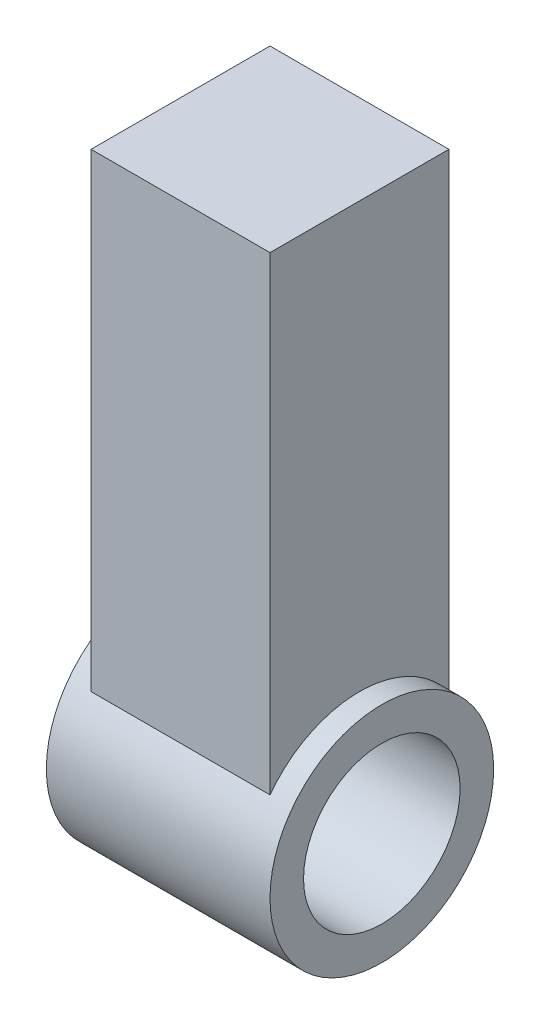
ISO-10303-21;
HEADER;
FILE_DESCRIPTION(('STEP AP214'),'2;1');
FILE_NAME('part.step','',(''),(''),'','','');
FILE_SCHEMA(('AUTOMOTIVE_DESIGN { 1 0 10303 214 1 1 1 1 }'));
ENDSEC;
DATA;
#1=APPLICATION_CONTEXT('core data for automotive mechanical design processes');
#2=APPLICATION_PROTOCOL_DEFINITION('international standard','automotive_design',2000,#1);
#3=PRODUCT_CONTEXT('',#1,'mechanical');
#4=PRODUCT('Part','Part','',(#3));
#5=PRODUCT_RELATED_PRODUCT_CATEGORY('part','',(#4));
#6=PRODUCT_DEFINITION_FORMATION('','',#4);
#7=PRODUCT_DEFINITION_CONTEXT('part definition',#1,'design');
#8=PRODUCT_DEFINITION('design','',#6,#7);
#9=PRODUCT_DEFINITION_SHAPE('','',#8);
#10=(LENGTH_UNIT() NAMED_UNIT(*) SI_UNIT(.MILLI.,.METRE.));
#11=(NAMED_UNIT(*) PLANE_ANGLE_UNIT() SI_UNIT($,.RADIAN.));
#12=(NAMED_UNIT(*) SI_UNIT($,.STERADIAN.) SOLID_ANGLE_UNIT());
#13=UNCERTAINTY_MEASURE_WITH_UNIT(LENGTH_MEASURE(1.E-05),#10,'distance_accuracy_value','');
#14=(GEOMETRIC_REPRESENTATION_CONTEXT(3) GLOBAL_UNCERTAINTY_ASSIGNED_CONTEXT((#13)) GLOBAL_UNIT_ASSIGNED_CONTEXT((#10,
#11,#12)) REPRESENTATION_CONTEXT('',''));
#15=CARTESIAN_POINT('',(0.,0.,0.));
#16=DIRECTION('',(0.,0.,1.));
#17=DIRECTION('',(1.,0.,0.));
#18=AXIS2_PLACEMENT_3D('',#15,#16,#17);
#19=CARTESIAN_POINT('',(20.,85.,-40.));
#20=DIRECTION('',(0.,0.,1.));
#21=DIRECTION('',(0.,-1.,0.));
#22=AXIS2_PLACEMENT_3D('',#19,#20,#21);
#23=PLANE('',#22);
#24=DIRECTION('',(0.,1.,0.));
#25=VECTOR('',#24,1.);
#26=CARTESIAN_POINT('',(-20.,85.,-40.));
#27=LINE('',#26,#25);
#28=CARTESIAN_POINT('',(-20.,-20.,-40.));
#29=VERTEX_POINT('',#28);
#30=CARTESIAN_POINT('',(-20.,85.,-40.));
#31=VERTEX_POINT('',#30);
#32=EDGE_CURVE('E86',#29,#31,#27,.T.);
#33=ORIENTED_EDGE('',*,*,#32,.T.);
#34=DIRECTION('',(-1.,0.,0.));
#35=VECTOR('',#34,1.);
#36=CARTESIAN_POINT('',(20.,85.,-40.));
#37=LINE('',#36,#35);
#38=CARTESIAN_POINT('',(20.,85.,-40.));
#39=VERTEX_POINT('',#38);
#40=EDGE_CURVE('E11',#39,#31,#37,.T.);
#41=ORIENTED_EDGE('',*,*,#40,.F.);
#42=DIRECTION('',(0.,1.,0.));
#43=VECTOR('',#42,1.);
#44=CARTESIAN_POINT('',(20.,85.,-40.));
#45=LINE('',#44,#43);
#46=CARTESIAN_POINT('',(20.,-20.,-40.));
#47=VERTEX_POINT('',#46);
#48=EDGE_CURVE('E52',#47,#39,#45,.T.);
#49=ORIENTED_EDGE('',*,*,#48,.F.);
#50=DIRECTION('',(-1.,0.,0.));
#51=VECTOR('',#50,1.);
#52=CARTESIAN_POINT('',(25.,-20.,-40.));
#53=LINE('',#52,#51);
#54=EDGE_CURVE('E78',#47,#29,#53,.T.);
#55=ORIENTED_EDGE('',*,*,#54,.T.);
#56=EDGE_LOOP('',(#33,#41,#49,#55));
#57=FACE_BOUND('',#56,.T.);
#58=ADVANCED_FACE('F33',(#57),#23,.F.);
#59=CARTESIAN_POINT('',(20.,85.,0.));
#60=DIRECTION('',(0.,-1.,0.));
#61=DIRECTION('',(0.,0.,-1.));
#62=AXIS2_PLACEMENT_3D('',#59,#60,#61);
#63=PLANE('',#62);
#64=DIRECTION('',(0.,0.,1.));
#65=VECTOR('',#64,1.);
#66=CARTESIAN_POINT('',(-20.,85.,0.));
#67=LINE('',#66,#65);
#68=CARTESIAN_POINT('',(-20.,85.,0.));
#69=VERTEX_POINT('',#68);
#70=EDGE_CURVE('E88',#31,#69,#67,.T.);
#71=ORIENTED_EDGE('',*,*,#70,.T.);
#72=DIRECTION('',(-1.,0.,0.));
#73=VECTOR('',#72,1.);
#74=CARTESIAN_POINT('',(20.,85.,0.));
#75=LINE('',#74,#73);
#76=CARTESIAN_POINT('',(20.,85.,0.));
#77=VERTEX_POINT('',#76);
#78=EDGE_CURVE('E40',#77,#69,#75,.T.);
#79=ORIENTED_EDGE('',*,*,#78,.F.);
#80=DIRECTION('',(0.,0.,1.));
#81=VECTOR('',#80,1.);
#82=CARTESIAN_POINT('',(20.,85.,0.));
#83=LINE('',#82,#81);
#84=EDGE_CURVE('E47',#39,#77,#83,.T.);
#85=ORIENTED_EDGE('',*,*,#84,.F.);
#86=ORIENTED_EDGE('',*,*,#40,.T.);
#87=EDGE_LOOP('',(#71,#79,#85,#86));
#88=FACE_BOUND('',#87,.T.);
#89=ADVANCED_FACE('F110',(#88),#63,.F.);
#90=CARTESIAN_POINT('',(20.,0.,0.));
#91=DIRECTION('',(0.,0.,-1.));
#92=DIRECTION('',(-1.,0.,0.));
#93=AXIS2_PLACEMENT_3D('',#90,#91,#92);
#94=PLANE('',#93);
#95=DIRECTION('',(0.,-1.,0.));
#96=VECTOR('',#95,1.);
#97=CARTESIAN_POINT('',(-20.,0.,0.));
#98=LINE('',#97,#96);
#99=CARTESIAN_POINT('',(-20.,-20.,0.));
#100=VERTEX_POINT('',#99);
#101=EDGE_CURVE('E100',#69,#100,#98,.T.);
#102=ORIENTED_EDGE('',*,*,#101,.T.);
#103=DIRECTION('',(-1.,0.,0.));
#104=VECTOR('',#103,1.);
#105=CARTESIAN_POINT('',(25.,-20.,0.));
#106=LINE('',#105,#104);
#107=CARTESIAN_POINT('',(20.,-20.,0.));
#108=VERTEX_POINT('',#107);
#109=EDGE_CURVE('E80',#100,#108,#106,.F.);
#110=ORIENTED_EDGE('',*,*,#109,.T.);
#111=DIRECTION('',(0.,-1.,0.));
#112=VECTOR('',#111,1.);
#113=CARTESIAN_POINT('',(20.,0.,0.));
#114=LINE('',#113,#112);
#115=EDGE_CURVE('E104',#77,#108,#114,.T.);
#116=ORIENTED_EDGE('',*,*,#115,.F.);
#117=ORIENTED_EDGE('',*,*,#78,.T.);
#118=EDGE_LOOP('',(#102,#110,#116,#117));
#119=FACE_BOUND('',#118,.T.);
#120=ADVANCED_FACE('F108',(#119),#94,.F.);
#121=CARTESIAN_POINT('',(20.,10.7179676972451,-40.));
#122=DIRECTION('',(1.,0.,0.));
#123=DIRECTION('',(0.,0.,-1.));
#124=AXIS2_PLACEMENT_3D('',#121,#122,#123);
#125=PLANE('',#124);
#126=ORIENTED_EDGE('',*,*,#115,.T.);
#127=CARTESIAN_POINT('',(20.,-35.,-20.));
#128=DIRECTION('',(1.,0.,0.));
#129=DIRECTION('',(0.,0.,-1.));
#130=AXIS2_PLACEMENT_3D('',#127,#128,#129);
#131=CIRCLE('',#130,25.);
#132=EDGE_CURVE('E91',#108,#47,#131,.F.);
#133=ORIENTED_EDGE('',*,*,#132,.T.);
#134=ORIENTED_EDGE('',*,*,#48,.T.);
#135=ORIENTED_EDGE('',*,*,#84,.T.);
#136=EDGE_LOOP('',(#126,#133,#134,#135));
#137=FACE_BOUND('',#136,.T.);
#138=ADVANCED_FACE('F116',(#137),#125,.T.);
#139=CARTESIAN_POINT('',(-20.,10.7179676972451,-40.));
#140=DIRECTION('',(1.,0.,0.));
#141=DIRECTION('',(0.,0.,-1.));
#142=AXIS2_PLACEMENT_3D('',#139,#140,#141);
#143=PLANE('',#142);
#144=ORIENTED_EDGE('',*,*,#32,.F.);
#145=CARTESIAN_POINT('',(-20.,-35.,-20.));
#146=DIRECTION('',(-1.,0.,0.));
#147=DIRECTION('',(0.,0.,1.));
#148=AXIS2_PLACEMENT_3D('',#145,#146,#147);
#149=CIRCLE('',#148,25.);
#150=EDGE_CURVE('E73',#29,#100,#149,.F.);
#151=ORIENTED_EDGE('',*,*,#150,.T.);
#152=ORIENTED_EDGE('',*,*,#101,.F.);
#153=ORIENTED_EDGE('',*,*,#70,.F.);
#154=EDGE_LOOP('',(#144,#151,#152,#153));
#155=FACE_BOUND('',#154,.T.);
#156=ADVANCED_FACE('F87',(#155),#143,.F.);
#157=CARTESIAN_POINT('',(25.,-35.,-20.));
#158=DIRECTION('',(1.,0.,0.));
#159=DIRECTION('',(0.,0.,-1.));
#160=AXIS2_PLACEMENT_3D('',#157,#158,#159);
#161=PLANE('',#160);
#162=CARTESIAN_POINT('',(25.,-35.,-20.));
#163=DIRECTION('',(1.,0.,0.));
#164=DIRECTION('',(0.,0.,-1.));
#165=AXIS2_PLACEMENT_3D('',#162,#163,#164);
#166=CIRCLE('',#165,25.);
#167=CARTESIAN_POINT('',(25.,-35.,-45.));
#168=VERTEX_POINT('',#167);
#169=EDGE_CURVE('E93',#168,#168,#166,.T.);
#170=ORIENTED_EDGE('',*,*,#169,.T.);
#171=EDGE_LOOP('',(#170));
#172=FACE_BOUND('',#171,.T.);
#173=CARTESIAN_POINT('',(25.,-35.,-20.));
#174=DIRECTION('',(1.,0.,0.));
#175=DIRECTION('',(0.,0.,-1.));
#176=AXIS2_PLACEMENT_3D('',#173,#174,#175);
#177=CIRCLE('',#176,17.5);
#178=CARTESIAN_POINT('',(25.,-35.,-37.5));
#179=VERTEX_POINT('',#178);
#180=EDGE_CURVE('E141',#179,#179,#177,.T.);
#181=ORIENTED_EDGE('',*,*,#180,.F.);
#182=EDGE_LOOP('',(#181));
#183=FACE_BOUND('',#182,.T.);
#184=ADVANCED_FACE('F123',(#172,#183),#161,.T.);
#185=CARTESIAN_POINT('',(-25.,-35.,-20.));
#186=DIRECTION('',(1.,0.,0.));
#187=DIRECTION('',(0.,0.,-1.));
#188=AXIS2_PLACEMENT_3D('',#185,#186,#187);
#189=PLANE('',#188);
#190=CARTESIAN_POINT('',(-25.,-35.,-20.));
#191=DIRECTION('',(1.,0.,0.));
#192=DIRECTION('',(0.,0.,-1.));
#193=AXIS2_PLACEMENT_3D('',#190,#191,#192);
#194=CIRCLE('',#193,25.);
#195=CARTESIAN_POINT('',(-25.,-35.,-45.));
#196=VERTEX_POINT('',#195);
#197=EDGE_CURVE('E147',#196,#196,#194,.T.);
#198=ORIENTED_EDGE('',*,*,#197,.F.);
#199=EDGE_LOOP('',(#198));
#200=FACE_BOUND('',#199,.T.);
#201=CARTESIAN_POINT('',(-25.,-35.,-20.));
#202=DIRECTION('',(1.,0.,0.));
#203=DIRECTION('',(0.,0.,-1.));
#204=AXIS2_PLACEMENT_3D('',#201,#202,#203);
#205=CIRCLE('',#204,17.5);
#206=CARTESIAN_POINT('',(-25.,-35.,-37.5));
#207=VERTEX_POINT('',#206);
#208=EDGE_CURVE('E144',#207,#207,#205,.T.);
#209=ORIENTED_EDGE('',*,*,#208,.T.);
#210=EDGE_LOOP('',(#209));
#211=FACE_BOUND('',#210,.T.);
#212=ADVANCED_FACE('F127',(#200,#211),#189,.F.);
#213=CARTESIAN_POINT('',(25.,-35.,-20.));
#214=DIRECTION('',(-1.,0.,0.));
#215=DIRECTION('',(0.,0.,1.));
#216=AXIS2_PLACEMENT_3D('',#213,#214,#215);
#217=CYLINDRICAL_SURFACE('',#216,25.);
#218=ORIENTED_EDGE('',*,*,#132,.F.);
#219=ORIENTED_EDGE('',*,*,#109,.F.);
#220=ORIENTED_EDGE('',*,*,#150,.F.);
#221=ORIENTED_EDGE('',*,*,#54,.F.);
#222=EDGE_LOOP('',(#218,#219,#220,#221));
#223=FACE_BOUND('',#222,.T.);
#224=ORIENTED_EDGE('',*,*,#169,.F.);
#225=EDGE_LOOP('',(#224));
#226=FACE_BOUND('',#225,.T.);
#227=ORIENTED_EDGE('',*,*,#197,.T.);
#228=EDGE_LOOP('',(#227));
#229=FACE_BOUND('',#228,.T.);
#230=ADVANCED_FACE('F75',(#223,#226,#229),#217,.T.);
#231=CARTESIAN_POINT('',(25.,-35.,-20.));
#232=DIRECTION('',(-1.,0.,0.));
#233=DIRECTION('',(0.,0.,1.));
#234=AXIS2_PLACEMENT_3D('',#231,#232,#233);
#235=CYLINDRICAL_SURFACE('',#234,17.5);
#236=ORIENTED_EDGE('',*,*,#180,.T.);
#237=EDGE_LOOP('',(#236));
#238=FACE_BOUND('',#237,.T.);
#239=ORIENTED_EDGE('',*,*,#208,.F.);
#240=EDGE_LOOP('',(#239));
#241=FACE_BOUND('',#240,.T.);
#242=ADVANCED_FACE('F126',(#238,#241),#235,.F.);
#243=CLOSED_SHELL('',(#58,#89,#120,#138,#156,#184,#212,#230,#242));
#244=MANIFOLD_SOLID_BREP('B2',#243);
#245=ADVANCED_BREP_SHAPE_REPRESENTATION('',(#18,#244),#14);
#246=SHAPE_DEFINITION_REPRESENTATION(#9,#245);
ENDSEC;
END-ISO-10303-21;
